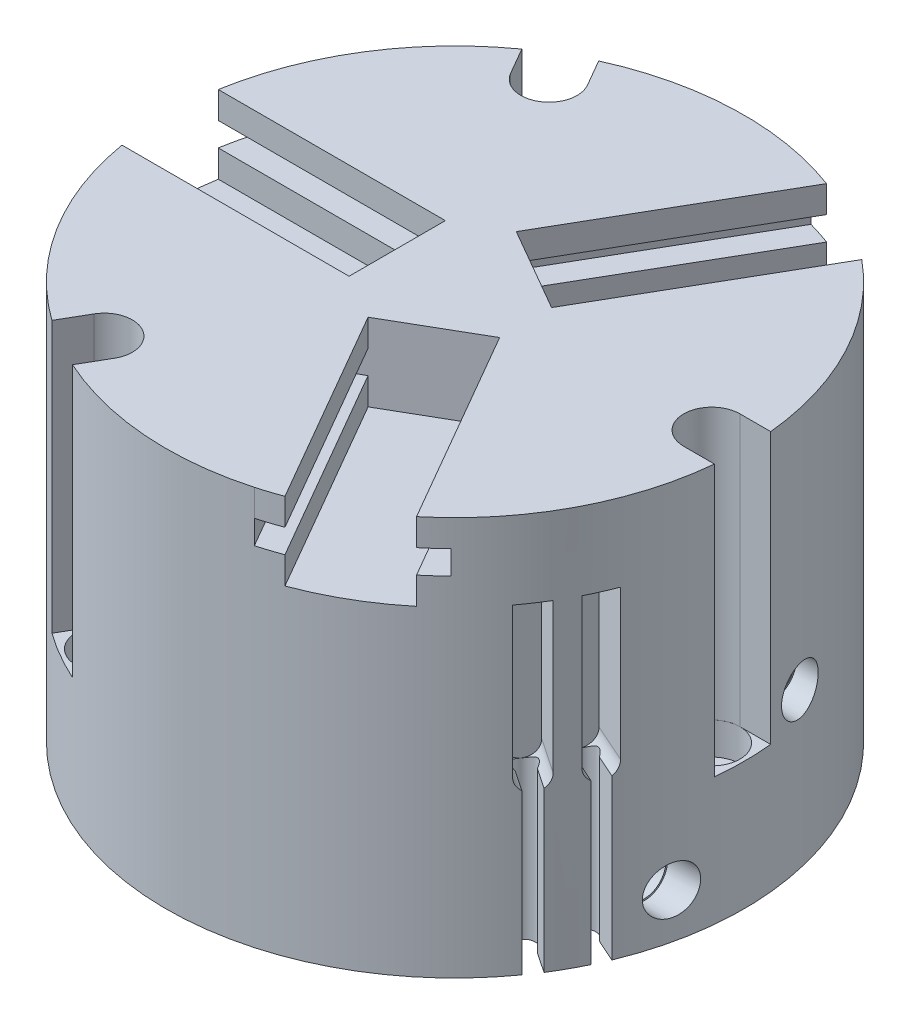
from build123d import *

# Parameters (mm, degrees)
SKETCH1_W                                        = 57.15
SKETCH1_H                                        = 78.867
CUT_EXTRUDE3_START                               = -53.594
CUT_EXTRUDE3_DEPTH                               = 53.594
CIRPATTERN2_COUNT                                = 3
CBORE_FOR_1_4_SOCKET_HEAD_CAP_SCREW1_D           = 6.5278
CBORE_FOR_1_4_SOCKET_HEAD_CAP_SCREW1_CBORE_D     = 11.1125
CBORE_FOR_1_4_SOCKET_HEAD_CAP_SCREW1_CBORE_DEPTH = 6.35
CIRPATTERN3_COUNT                                = 3
CIRPATTERN4_COUNT                                = 2
F_1_8_NPT_TAPPED_HOLE1_AT_2_COUNT                = 2
F_1_8_NPT_TAPPED_HOLE1_AT_2_PITCH                = 33.374710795
CUT_EXTRUDE6_DEPTH                               = 32.004
CUT_EXTRUDE5_DEPTH                               = 6.35
CUT_EXTRUDE5_DEPTH_BACK                          = 8.46582
CUT_EXTRUDE7_DEPTH                               = 32.004
CUT_EXTRUDE8_DEPTH                               = 6.35
CUT_EXTRUDE8_DEPTH_BACK                          = 8.46582
CUT_EXTRUDE9_DEPTH                               = 45.72
CIRPATTERN5_COUNT                                = 3


with BuildPart() as part:
    # Sketch1 → Revolve1 (revolve)
    with BuildSketch(Plane.XY, mode=Mode.PRIVATE) as revolve1_sk:
        with Locations((-28.575, 0)):
            Rectangle(SKETCH1_W, SKETCH1_H)
    revolve(revolve1_sk.sketch.rotate(Axis((0, 75.054553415, 0), (0, -1, 0)), 270), axis=Axis((0, 75.054553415, 0), (0, -1, 0)))

    # Sketch2 → Cut-Extrude3 (cut)
    with BuildSketch(Plane(origin=(0, 39.4335, 0), x_dir=(-1, 0, 0), z_dir=(0, 1, 0)).offset(CUT_EXTRUDE3_START)):
        with BuildLine():
            Line((-56.878642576, -5.5626), (-50.8, -5.5626))
            ThreePointArc((-50.8, -5.5626), (-45.2374, 0), (-50.8, 5.5626))
            Line((-50.8, 5.5626), (-56.878642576, 5.5626))
            ThreePointArc((-56.878642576, 5.5626), (-57.15, 0), (-56.878642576, -5.5626))
        make_face()
    cut_extrude3 = extrude(amount=CUT_EXTRUDE3_DEPTH, mode=Mode.SUBTRACT)

    # CirPattern2: Cut-Extrude3 ×3 about axis
    cirpattern2_axis = Axis((0, 0, 0), (0, 1, 0))
    for i in range(1, CIRPATTERN2_COUNT):
        add(cut_extrude3.rotate(cirpattern2_axis, i * 360 / CIRPATTERN2_COUNT), mode=Mode.SUBTRACT)

    # CBORE for 1_4 Socket Head Cap Screw1 (through all)
    with Locations(Plane(origin=(50.8, -14.1605, 0), x_dir=(0, 0, 1), z_dir=(0, 1, 0))):
        with Locations((0, 0)):
            cbore_for_1_4_socket_head_cap_screw1 = CounterBoreHole(CBORE_FOR_1_4_SOCKET_HEAD_CAP_SCREW1_D / 2, CBORE_FOR_1_4_SOCKET_HEAD_CAP_SCREW1_CBORE_D / 2, CBORE_FOR_1_4_SOCKET_HEAD_CAP_SCREW1_CBORE_DEPTH)

    # CirPattern3: CBORE for 1_4 Socket Head Cap Screw1 ×3 about axis
    cirpattern3_axis = Axis((0, 0, 0), (0, 1, 0))
    for i in range(1, CIRPATTERN3_COUNT):
        add(cbore_for_1_4_socket_head_cap_screw1.rotate(cirpattern3_axis, i * 360 / CIRPATTERN3_COUNT), mode=Mode.SUBTRACT)

    # Sketch6 → 1_4 _0.25_ Diameter Hole1 (revolve, cut)
    with BuildSketch(Plane(origin=(0, -39.4335, -50.8), x_dir=(0, 0, -1), z_dir=(1, 0, 0))):
        Polygon((0, 0), (0, 14.607732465), (3.175, 12.7), (3.175, 0), align=None)
    f_1_4_0_25_diameter_hole1 = revolve(axis=Axis((0, -45.7835, -50.8), (0, 1, 0)), mode=Mode.SUBTRACT)

    # CirPattern4: 1_4 _0.25_ Diameter Hole1 ×2 about axis
    cirpattern4_axis = Axis((0, 0, 0), (0, 1, 0))
    for i in range(1, CIRPATTERN4_COUNT):
        add(f_1_4_0_25_diameter_hole1.rotate(cirpattern4_axis, i * 360 / CIRPATTERN4_COUNT), mode=Mode.SUBTRACT)

    # Sketch10 → 1_8 NPT Tapped Hole1 (revolve, cut)
    with BuildSketch(Plane(origin=(57.15, -30.5435, 12.7254), x_dir=(0, 0, -1), z_dir=(0, 1, 0))):
        Polygon((0, 0), (0, 12.7), (4.2164, 12.7), (4.2164, 6.9342), (4.537405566, 6.9342), (4.7450248, 0), align=None)
    f_1_8_npt_tapped_hole1 = revolve(axis=Axis((63.5, -30.5435, 12.7254), (-1, 0, 0)), mode=Mode.SUBTRACT)

    # 1_8 NPT Tapped Hole1 at 2: 1_8 NPT Tapped Hole1 ×2
    with Locations(*[Vector(0, 0.6468969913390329, -0.7625773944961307) * (i * F_1_8_NPT_TAPPED_HOLE1_AT_2_PITCH) for i in range(1, F_1_8_NPT_TAPPED_HOLE1_AT_2_COUNT)]):
        add(f_1_8_npt_tapped_hole1, mode=Mode.SUBTRACT)

    # Sketch13 → Cut-Extrude6 (cut)
    with BuildSketch(Plane.XZ.offset(39.4335)):
        with BuildLine():
            Line((51.548768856, 24.674823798), (47.048015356, 22.670959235))
            ThreePointArc((47.048015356, 22.670959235), (44.482172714, 19.804739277), (48.329073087, 19.793656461))
            Line((48.329073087, 19.793656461), (52.829826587, 21.797521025))
            ThreePointArc((52.829826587, 21.797521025), (52.209122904, 23.244999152), (51.548768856, 24.674823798))
        make_face()
    extrude(amount=-CUT_EXTRUDE6_DEPTH, mode=Mode.SUBTRACT)

    # Sketch12 → Cut-Extrude5 (cut, two sides: drawn at the far end of the back side and taken through both)
    with BuildSketch(Plane(origin=(52.147771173, 0, 23.329442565), x_dir=(0.4067366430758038, 0, -0.9135454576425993), z_dir=(0.9135454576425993, 0, 0.4067366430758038)).offset(-CUT_EXTRUDE5_DEPTH_BACK)):
        with BuildLine():
            Line((2.997696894, 24.0665), (2.997696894, -5.4483))
            ThreePointArc((2.997696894, -5.4483), (0.102096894, -8.3439), (-2.793503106, -5.4483))
            Line((-2.793503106, -5.4483), (-2.793503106, 24.0665))
            Line((-2.793503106, 24.0665), (2.997696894, 24.0665))
        make_face()
    extrude(amount=CUT_EXTRUDE5_DEPTH + CUT_EXTRUDE5_DEPTH_BACK, mode=Mode.SUBTRACT)

    # Sketch14 → Cut-Extrude7 (cut)
    with BuildSketch(Plane.XZ.offset(39.4335)):
        with BuildLine():
            Line((46.48088904, 33.251307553), (42.396479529, 30.496338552))
            ThreePointArc((42.396479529, 30.496338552), (40.367331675, 27.228109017), (44.157713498, 27.885201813))
            Line((44.157713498, 27.885201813), (48.242123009, 30.640170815))
            ThreePointArc((48.242123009, 30.640170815), (47.379497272, 31.957874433), (46.48088904, 33.251307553))
        make_face()
    extrude(amount=-CUT_EXTRUDE7_DEPTH, mode=Mode.SUBTRACT)

    # Sketch15 → Cut-Extrude8 (cut, two sides: drawn at the far end of the back side and taken through both)
    with BuildSketch(Plane(origin=(47.361506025, 0, 31.945739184), x_dir=(0.5591929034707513, 0, -0.8290375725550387), z_dir=(0.8290375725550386, 0, 0.5591929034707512)).offset(-CUT_EXTRUDE8_DEPTH_BACK)):
        with BuildLine():
            Line((-2.8956, 24.0665), (-2.8956, -5.4483))
            ThreePointArc((-2.8956, -5.4483), (0, -8.3439), (2.8956, -5.4483))
            Line((2.8956, -5.4483), (2.8956, 24.0665))
            Line((2.8956, 24.0665), (-2.8956, 24.0665))
        make_face()
    extrude(amount=CUT_EXTRUDE8_DEPTH + CUT_EXTRUDE8_DEPTH_BACK, mode=Mode.SUBTRACT)

    # Sketch16 → Cut-Extrude9 (cut)
    with BuildSketch(Plane(origin=(28.575, 0, -49.493351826), x_dir=(-0.8660254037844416, 0, -0.49999999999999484), z_dir=(0.49999999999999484, 0, -0.8660254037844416))):
        Polygon((-9.525, 41.8465), (9.525, 41.8465), (9.525, 34.1249), (14.224, 34.1249), (14.224, 29.4259), (9.525, 29.4259), (9.525, 24.0665), (-9.525, 24.0665), (-9.525, 29.4259), (-14.224, 29.4259), (-14.224, 34.1249), (-9.525, 34.1249), align=None)
    cut_extrude9 = extrude(amount=-CUT_EXTRUDE9_DEPTH, mode=Mode.SUBTRACT)

    # CirPattern5: Cut-Extrude9 ×3 about axis
    cirpattern5_axis = Axis((0, 0, 0), (0, 1, 0))
    for i in range(1, CIRPATTERN5_COUNT):
        add(cut_extrude9.rotate(cirpattern5_axis, i * 360 / CIRPATTERN5_COUNT), mode=Mode.SUBTRACT)


solid = part.part
